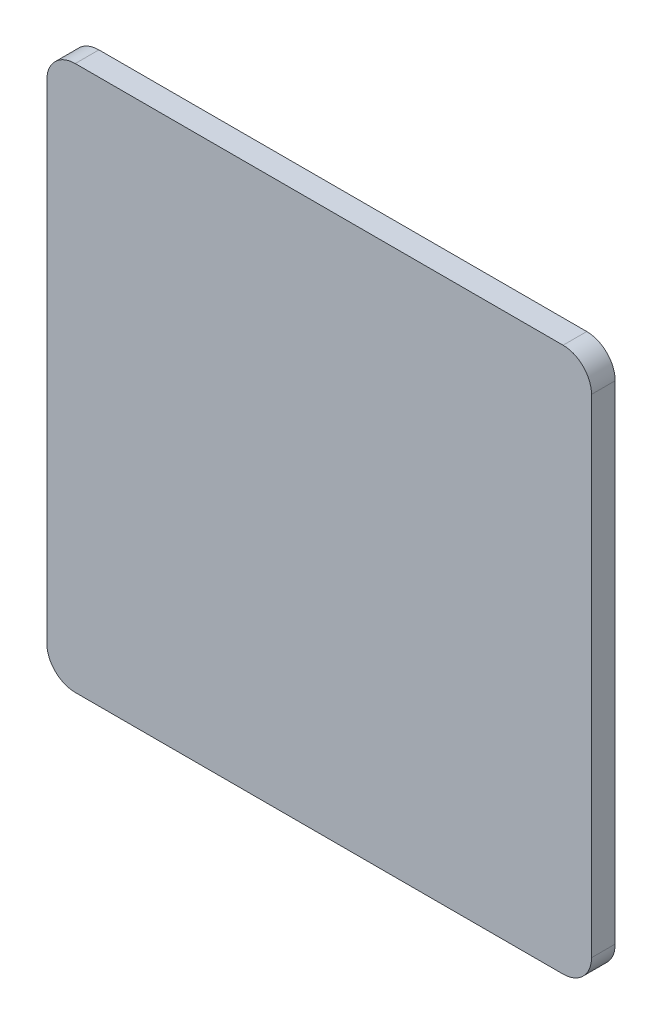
from build123d import *

# Parameters (mm, degrees)
EXTRUDE1_DEPTH = 6.35


with BuildPart() as part:
    # Sketch1 → Extrude1 (new body)
    with BuildSketch(Plane.XY):
        with BuildLine():
            Line((65.405, 73.025), (-65.405, 73.025))
            ThreePointArc((-65.405, 73.025), (-70.793153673, 70.793153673), (-73.025, 65.405))
            Line((-73.025, 65.405), (-73.025, -65.405))
            ThreePointArc((-73.025, -65.405), (-70.793153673, -70.793153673), (-65.405, -73.025))
            Line((-65.405, -73.025), (65.405, -73.025))
            ThreePointArc((65.405, -73.025), (70.793153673, -70.793153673), (73.025, -65.405))
            Line((73.025, -65.405), (73.025, 65.405))
            ThreePointArc((73.025, 65.405), (70.793153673, 70.793153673), (65.405, 73.025))
        make_face()
    extrude(amount=EXTRUDE1_DEPTH)


solid = part.part
